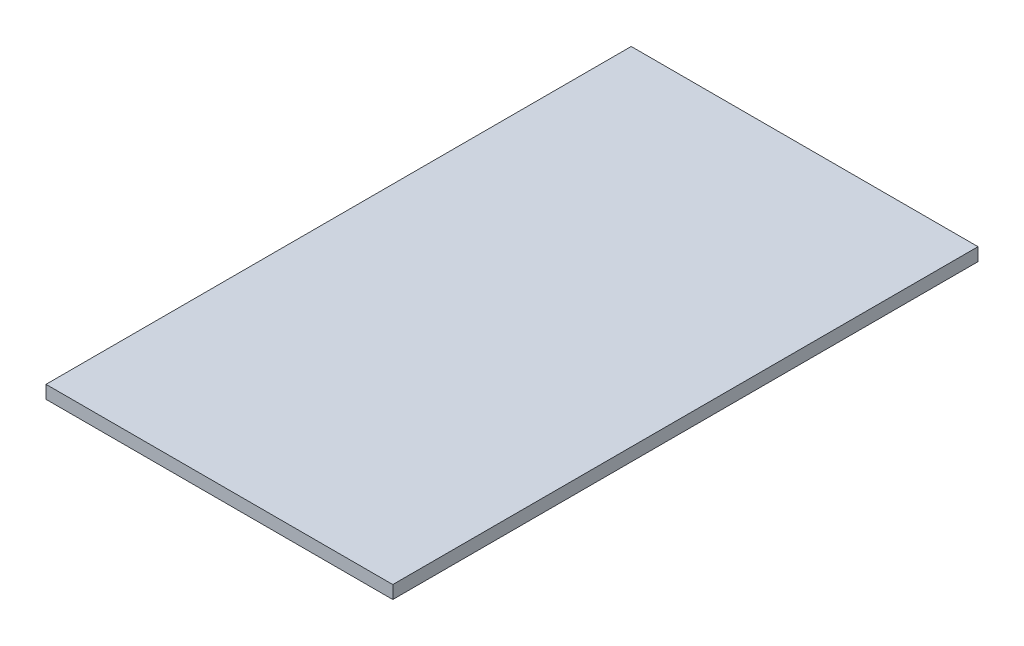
from build123d import *

# Parameters (mm, degrees)
SKETCH1_W      = 40
SKETCH1_H      = 1.5
EXTRUDE1_DEPTH = 67.5


with BuildPart() as part:
    # Sketch1 → Extrude1 (new body)
    with BuildSketch(Plane.XY):
        with Locations((20, 0.75)):
            Rectangle(SKETCH1_W, SKETCH1_H)
    extrude(amount=EXTRUDE1_DEPTH)


solid = part.part
